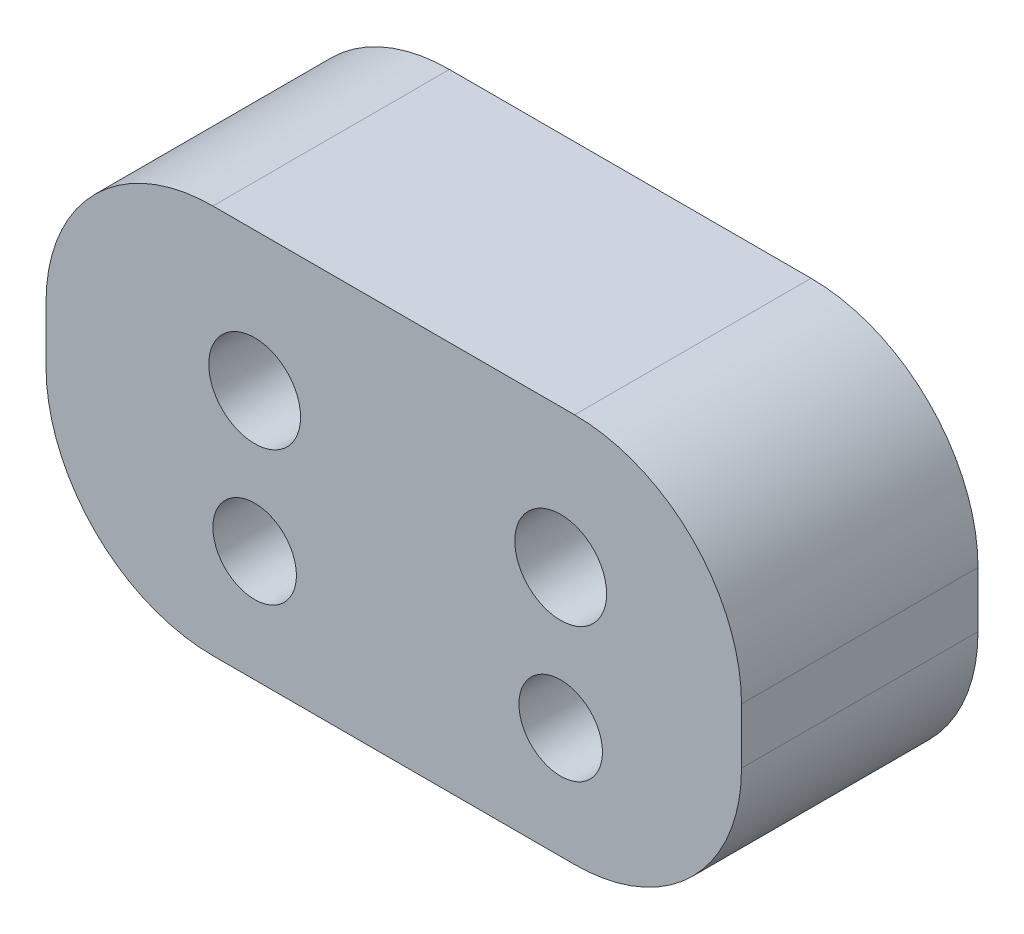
from build123d import *

# Parameters (mm, degrees)
ESQUISSE1_R                               = 1.5
BOSS_EXTRU_1_DEPTH                        = 8.5
TROU_POUR_TARAUDAGE_POUR_TROU_TARAUD_M4_D = 3.3


with BuildPart() as part:
    # Esquisse1 → Boss.-Extru.1 (new body)
    with BuildSketch(Plane.XY):
        with BuildLine():
            Line((6, -14), (19, -14))
            ThreePointArc((19, -14), (23.242640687, -12.242640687), (25, -8))
            Line((25, -8), (25, -6))
            ThreePointArc((25, -6), (23.242640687, -1.757359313), (19, 0))
            Line((19, 0), (6, 0))
            ThreePointArc((6, 0), (1.757359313, -1.757359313), (0, -6))
            Line((0, -6), (0, -8))
            ThreePointArc((0, -8), (1.757359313, -12.242640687), (6, -14))
        make_face()
        with Locations(Location((7.5, -10, 0), (0, 0, 180))):
            Circle(ESQUISSE1_R, mode=Mode.SUBTRACT)
        with Locations(Location((18.5, -10, 0), (0, 0, 180))):
            Circle(ESQUISSE1_R, mode=Mode.SUBTRACT)
    extrude(amount=-BOSS_EXTRU_1_DEPTH)

    # Trou pour taraudage pour trou taraud_ M4 (through all)
    with Locations(Plane.XY):
        with Locations((7.5, -5), (18.5, -5)):
            Hole(TROU_POUR_TARAUDAGE_POUR_TROU_TARAUD_M4_D / 2)


solid = part.part
